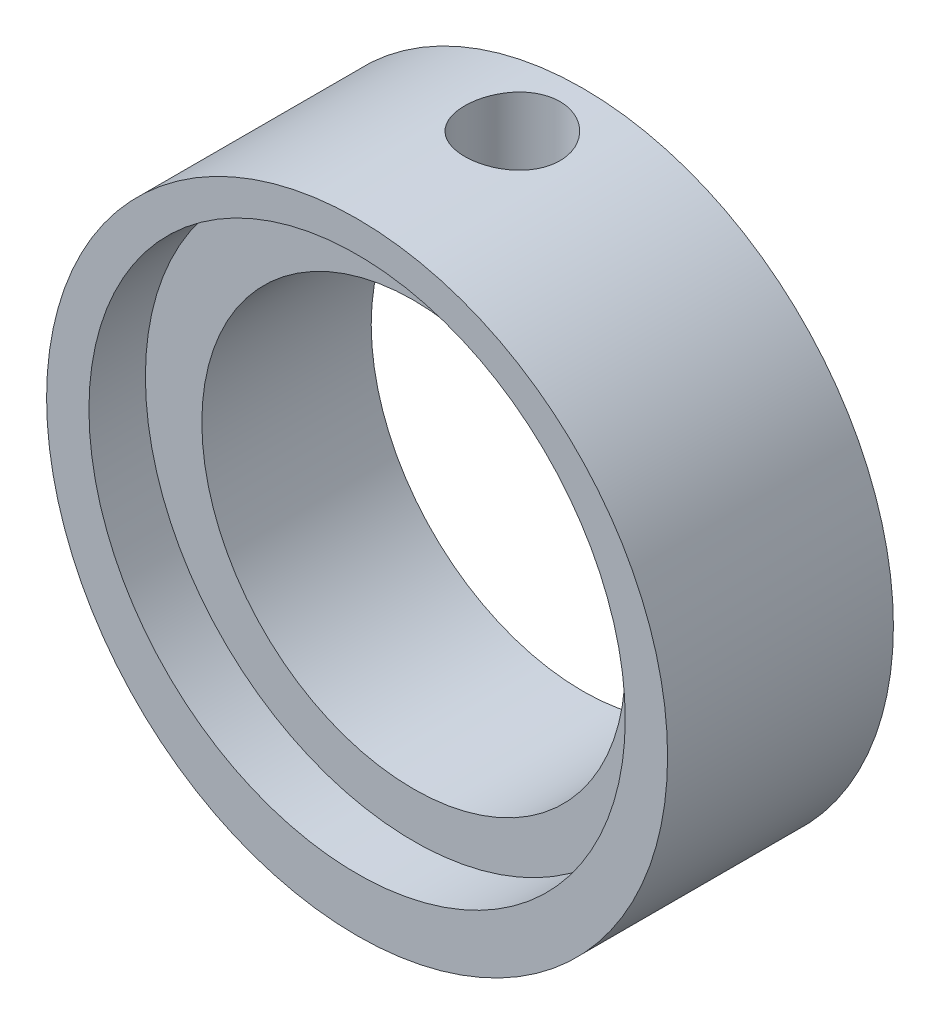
from build123d import *

# Parameters (mm, degrees)
ESQUISSE1_R             = 22
ESQUISSE1_R_2           = 15
BASE_EXTRUSION_DEPTH    = 16
ENL_V_START             = -4
ESQUISSE2_R             = 19
ESQUISSE2_R_2           = 15
ENL_V_MAT_EXTRU_1_DEPTH = 4
ESQUISSE3_R             = 3.375
ENL_V_MAT_EXTRU_2_DEPTH = 35.985711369


with BuildPart() as part:
    # Esquisse1 → Base-Extrusion (new body)
    with BuildSketch(Plane.XY):
        Circle(ESQUISSE1_R)
        Circle(ESQUISSE1_R_2, mode=Mode.SUBTRACT)
    extrude(amount=BASE_EXTRUSION_DEPTH)

    # Esquisse2 → Enl_v. mat.-Extru.1 (cut)
    with BuildSketch(Plane.XY.offset(16).offset(ENL_V_START)):
        with Locations((0, 0.8)):
            Circle(ESQUISSE2_R)
        Circle(ESQUISSE2_R_2, mode=Mode.SUBTRACT)
    extrude(amount=ENL_V_MAT_EXTRU_1_DEPTH, mode=Mode.SUBTRACT)

    # Esquisse3 → Enl_v. mat.-Extru.2 (cut, through all)
    with BuildSketch(Plane(origin=(0, 0, 0), x_dir=(1, 0, 0), z_dir=(0, 1, 0))):
        with Locations(Location((0, -5, 0), (0, 0, 90))):
            Circle(ESQUISSE3_R)
    extrude(amount=ENL_V_MAT_EXTRU_2_DEPTH, mode=Mode.SUBTRACT)


solid = part.part
